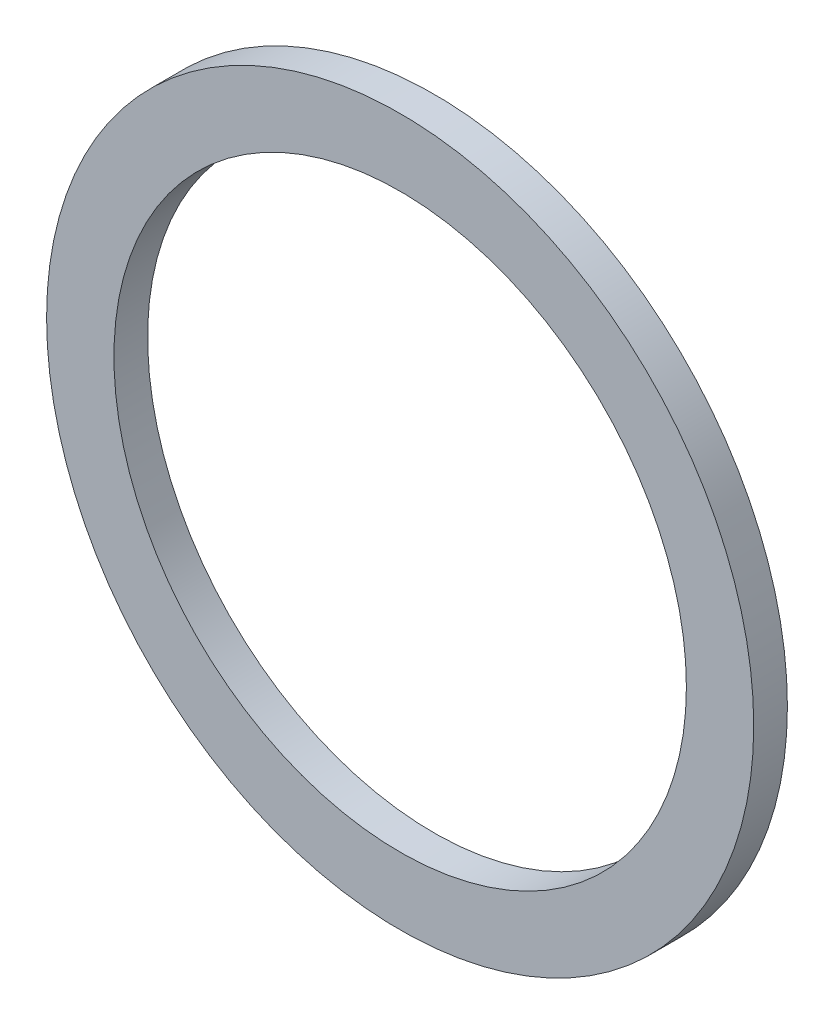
from build123d import *

# Parameters (mm, degrees)
SKETCH1_R      = 10.5
SKETCH1_R_2    = 8.5
EXTRUDE1_DEPTH = 1


with BuildPart() as part:
    # Sketch1 → Extrude1 (new body)
    with BuildSketch(Plane.XY):
        Circle(SKETCH1_R)
        Circle(SKETCH1_R_2, mode=Mode.SUBTRACT)
    extrude(amount=EXTRUDE1_DEPTH)


solid = part.part
